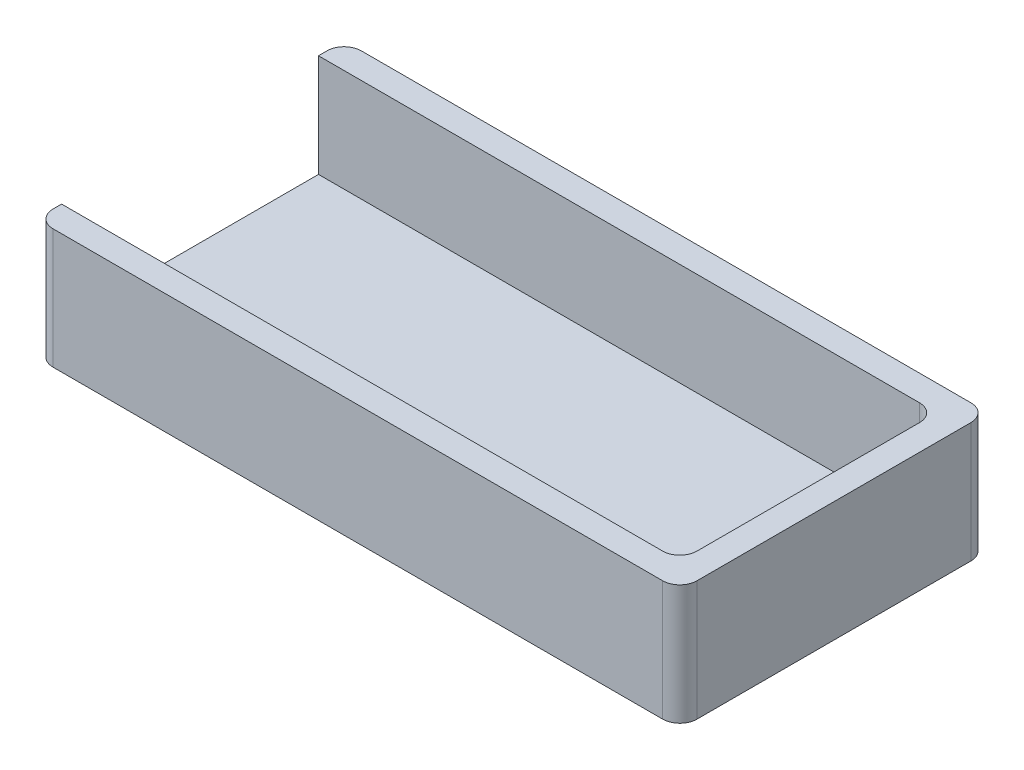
ISO-10303-21;
HEADER;
FILE_DESCRIPTION(('STEP AP214'),'2;1');
FILE_NAME('part.step','',(''),(''),'','','');
FILE_SCHEMA(('AUTOMOTIVE_DESIGN { 1 0 10303 214 1 1 1 1 }'));
ENDSEC;
DATA;
#1=APPLICATION_CONTEXT('core data for automotive mechanical design processes');
#2=APPLICATION_PROTOCOL_DEFINITION('international standard','automotive_design',2000,#1);
#3=PRODUCT_CONTEXT('',#1,'mechanical');
#4=PRODUCT('Part','Part','',(#3));
#5=PRODUCT_RELATED_PRODUCT_CATEGORY('part','',(#4));
#6=PRODUCT_DEFINITION_FORMATION('','',#4);
#7=PRODUCT_DEFINITION_CONTEXT('part definition',#1,'design');
#8=PRODUCT_DEFINITION('design','',#6,#7);
#9=PRODUCT_DEFINITION_SHAPE('','',#8);
#10=(LENGTH_UNIT() NAMED_UNIT(*) SI_UNIT(.MILLI.,.METRE.));
#11=(NAMED_UNIT(*) PLANE_ANGLE_UNIT() SI_UNIT($,.RADIAN.));
#12=(NAMED_UNIT(*) SI_UNIT($,.STERADIAN.) SOLID_ANGLE_UNIT());
#13=UNCERTAINTY_MEASURE_WITH_UNIT(LENGTH_MEASURE(1.E-05),#10,'distance_accuracy_value','');
#14=(GEOMETRIC_REPRESENTATION_CONTEXT(3) GLOBAL_UNCERTAINTY_ASSIGNED_CONTEXT((#13)) GLOBAL_UNIT_ASSIGNED_CONTEXT((#10,
#11,#12)) REPRESENTATION_CONTEXT('',''));
#15=CARTESIAN_POINT('',(0.,0.,0.));
#16=DIRECTION('',(0.,0.,1.));
#17=DIRECTION('',(1.,0.,0.));
#18=AXIS2_PLACEMENT_3D('',#15,#16,#17);
#19=CARTESIAN_POINT('',(0.,1.,0.));
#20=DIRECTION('',(0.,-1.,0.));
#21=DIRECTION('',(0.,0.,-1.));
#22=AXIS2_PLACEMENT_3D('',#19,#20,#21);
#23=PLANE('',#22);
#24=DIRECTION('',(0.,0.,1.));
#25=VECTOR('',#24,1.);
#26=CARTESIAN_POINT('',(36.1,1.,-1.5));
#27=LINE('',#26,#25);
#28=CARTESIAN_POINT('',(36.1,1.,-15.5));
#29=VERTEX_POINT('',#28);
#30=CARTESIAN_POINT('',(36.1,1.,-2.5));
#31=VERTEX_POINT('',#30);
#32=EDGE_CURVE('E187',#29,#31,#27,.T.);
#33=ORIENTED_EDGE('',*,*,#32,.F.);
#34=CARTESIAN_POINT('',(35.1,1.,-15.5));
#35=DIRECTION('',(0.,-1.,0.));
#36=DIRECTION('',(0.,0.,-1.));
#37=AXIS2_PLACEMENT_3D('',#34,#35,#36);
#38=CIRCLE('',#37,1.);
#39=CARTESIAN_POINT('',(35.1,1.,-16.5));
#40=VERTEX_POINT('',#39);
#41=EDGE_CURVE('E258',#29,#40,#38,.F.);
#42=ORIENTED_EDGE('',*,*,#41,.T.);
#43=DIRECTION('',(1.,0.,0.));
#44=VECTOR('',#43,1.);
#45=CARTESIAN_POINT('',(36.1,1.,-16.5));
#46=LINE('',#45,#44);
#47=CARTESIAN_POINT('',(0.,1.,-16.5));
#48=VERTEX_POINT('',#47);
#49=EDGE_CURVE('E199',#48,#40,#46,.T.);
#50=ORIENTED_EDGE('',*,*,#49,.F.);
#51=DIRECTION('',(0.,0.,1.));
#52=VECTOR('',#51,1.);
#53=CARTESIAN_POINT('',(0.,1.,0.));
#54=LINE('',#53,#52);
#55=CARTESIAN_POINT('',(0.,1.,-1.5));
#56=VERTEX_POINT('',#55);
#57=EDGE_CURVE('E163',#48,#56,#54,.T.);
#58=ORIENTED_EDGE('',*,*,#57,.T.);
#59=DIRECTION('',(-1.,0.,0.));
#60=VECTOR('',#59,1.);
#61=CARTESIAN_POINT('',(0.,1.,-1.5));
#62=LINE('',#61,#60);
#63=CARTESIAN_POINT('',(35.1,1.,-1.5));
#64=VERTEX_POINT('',#63);
#65=EDGE_CURVE('E147',#64,#56,#62,.T.);
#66=ORIENTED_EDGE('',*,*,#65,.F.);
#67=CARTESIAN_POINT('',(35.1,1.,-2.5));
#68=DIRECTION('',(0.,-1.,0.));
#69=DIRECTION('',(0.,0.,-1.));
#70=AXIS2_PLACEMENT_3D('',#67,#68,#69);
#71=CIRCLE('',#70,1.);
#72=EDGE_CURVE('E184',#64,#31,#71,.F.);
#73=ORIENTED_EDGE('',*,*,#72,.T.);
#74=EDGE_LOOP('',(#33,#42,#50,#58,#66,#73));
#75=FACE_BOUND('',#74,.T.);
#76=ADVANCED_FACE('F33',(#75),#23,.F.);
#77=CARTESIAN_POINT('',(0.,1.,0.));
#78=DIRECTION('',(1.,0.,0.));
#79=DIRECTION('',(0.,0.,-1.));
#80=AXIS2_PLACEMENT_3D('',#77,#78,#79);
#81=PLANE('',#80);
#82=DIRECTION('',(0.,0.,1.));
#83=VECTOR('',#82,1.);
#84=CARTESIAN_POINT('',(0.,0.,0.));
#85=LINE('',#84,#83);
#86=CARTESIAN_POINT('',(0.,0.,-17.));
#87=VERTEX_POINT('',#86);
#88=CARTESIAN_POINT('',(0.,0.,-1.));
#89=VERTEX_POINT('',#88);
#90=EDGE_CURVE('E164',#87,#89,#85,.T.);
#91=ORIENTED_EDGE('',*,*,#90,.T.);
#92=DIRECTION('',(0.,-1.,0.));
#93=VECTOR('',#92,1.);
#94=CARTESIAN_POINT('',(0.,1.,-1.));
#95=LINE('',#94,#93);
#96=CARTESIAN_POINT('',(0.,7.,-1.));
#97=VERTEX_POINT('',#96);
#98=EDGE_CURVE('E255',#89,#97,#95,.F.);
#99=ORIENTED_EDGE('',*,*,#98,.T.);
#100=DIRECTION('',(0.,0.,1.));
#101=VECTOR('',#100,1.);
#102=CARTESIAN_POINT('',(0.,7.,0.));
#103=LINE('',#102,#101);
#104=CARTESIAN_POINT('',(0.,7.,-1.5));
#105=VERTEX_POINT('',#104);
#106=EDGE_CURVE('E222',#105,#97,#103,.T.);
#107=ORIENTED_EDGE('',*,*,#106,.F.);
#108=DIRECTION('',(0.,-1.,0.));
#109=VECTOR('',#108,1.);
#110=CARTESIAN_POINT('',(0.,7.,-1.5));
#111=LINE('',#110,#109);
#112=EDGE_CURVE('E165',#105,#56,#111,.T.);
#113=ORIENTED_EDGE('',*,*,#112,.T.);
#114=ORIENTED_EDGE('',*,*,#57,.F.);
#115=DIRECTION('',(0.,-1.,0.));
#116=VECTOR('',#115,1.);
#117=CARTESIAN_POINT('',(0.,7.,-16.5));
#118=LINE('',#117,#116);
#119=CARTESIAN_POINT('',(0.,7.,-16.5));
#120=VERTEX_POINT('',#119);
#121=EDGE_CURVE('E153',#120,#48,#118,.T.);
#122=ORIENTED_EDGE('',*,*,#121,.F.);
#123=DIRECTION('',(0.,0.,1.));
#124=VECTOR('',#123,1.);
#125=CARTESIAN_POINT('',(0.,7.,-16.5));
#126=LINE('',#125,#124);
#127=CARTESIAN_POINT('',(0.,7.,-17.));
#128=VERTEX_POINT('',#127);
#129=EDGE_CURVE('E134',#128,#120,#126,.T.);
#130=ORIENTED_EDGE('',*,*,#129,.F.);
#131=DIRECTION('',(0.,-1.,0.));
#132=VECTOR('',#131,1.);
#133=CARTESIAN_POINT('',(0.,1.,-17.));
#134=LINE('',#133,#132);
#135=EDGE_CURVE('E239',#128,#87,#134,.T.);
#136=ORIENTED_EDGE('',*,*,#135,.T.);
#137=EDGE_LOOP('',(#91,#99,#107,#113,#114,#122,#130,#136));
#138=FACE_BOUND('',#137,.T.);
#139=ADVANCED_FACE('F160',(#138),#81,.F.);
#140=CARTESIAN_POINT('',(0.,1.,0.));
#141=DIRECTION('',(0.,0.,-1.));
#142=DIRECTION('',(-1.,0.,0.));
#143=AXIS2_PLACEMENT_3D('',#140,#141,#142);
#144=PLANE('',#143);
#145=DIRECTION('',(1.,0.,0.));
#146=VECTOR('',#145,1.);
#147=CARTESIAN_POINT('',(0.,0.,0.));
#148=LINE('',#147,#146);
#149=CARTESIAN_POINT('',(1.,0.,0.));
#150=VERTEX_POINT('',#149);
#151=CARTESIAN_POINT('',(36.6,0.,0.));
#152=VERTEX_POINT('',#151);
#153=EDGE_CURVE('E167',#150,#152,#148,.T.);
#154=ORIENTED_EDGE('',*,*,#153,.T.);
#155=DIRECTION('',(0.,-1.,0.));
#156=VECTOR('',#155,1.);
#157=CARTESIAN_POINT('',(36.6,1.,0.));
#158=LINE('',#157,#156);
#159=CARTESIAN_POINT('',(36.6,7.,0.));
#160=VERTEX_POINT('',#159);
#161=EDGE_CURVE('E48',#152,#160,#158,.F.);
#162=ORIENTED_EDGE('',*,*,#161,.T.);
#163=DIRECTION('',(1.,0.,0.));
#164=VECTOR('',#163,1.);
#165=CARTESIAN_POINT('',(37.6,7.,0.));
#166=LINE('',#165,#164);
#167=CARTESIAN_POINT('',(1.,7.,0.));
#168=VERTEX_POINT('',#167);
#169=EDGE_CURVE('E224',#168,#160,#166,.T.);
#170=ORIENTED_EDGE('',*,*,#169,.F.);
#171=DIRECTION('',(0.,-1.,0.));
#172=VECTOR('',#171,1.);
#173=CARTESIAN_POINT('',(1.,1.,0.));
#174=LINE('',#173,#172);
#175=EDGE_CURVE('E250',#168,#150,#174,.T.);
#176=ORIENTED_EDGE('',*,*,#175,.T.);
#177=EDGE_LOOP('',(#154,#162,#170,#176));
#178=FACE_BOUND('',#177,.T.);
#179=ADVANCED_FACE('F288',(#178),#144,.F.);
#180=CARTESIAN_POINT('',(37.6,1.,0.));
#181=DIRECTION('',(-1.,0.,0.));
#182=DIRECTION('',(0.,0.,1.));
#183=AXIS2_PLACEMENT_3D('',#180,#181,#182);
#184=PLANE('',#183);
#185=DIRECTION('',(0.,0.,-1.));
#186=VECTOR('',#185,1.);
#187=CARTESIAN_POINT('',(37.6,0.,0.));
#188=LINE('',#187,#186);
#189=CARTESIAN_POINT('',(37.6,0.,-1.));
#190=VERTEX_POINT('',#189);
#191=CARTESIAN_POINT('',(37.6,0.,-17.));
#192=VERTEX_POINT('',#191);
#193=EDGE_CURVE('E279',#190,#192,#188,.T.);
#194=ORIENTED_EDGE('',*,*,#193,.T.);
#195=DIRECTION('',(0.,-1.,0.));
#196=VECTOR('',#195,1.);
#197=CARTESIAN_POINT('',(37.6,1.,-17.));
#198=LINE('',#197,#196);
#199=CARTESIAN_POINT('',(37.6,7.,-17.));
#200=VERTEX_POINT('',#199);
#201=EDGE_CURVE('E240',#192,#200,#198,.F.);
#202=ORIENTED_EDGE('',*,*,#201,.T.);
#203=DIRECTION('',(0.,0.,-1.));
#204=VECTOR('',#203,1.);
#205=CARTESIAN_POINT('',(37.6,7.,-18.));
#206=LINE('',#205,#204);
#207=CARTESIAN_POINT('',(37.6,7.,-1.));
#208=VERTEX_POINT('',#207);
#209=EDGE_CURVE('E229',#208,#200,#206,.T.);
#210=ORIENTED_EDGE('',*,*,#209,.F.);
#211=DIRECTION('',(0.,-1.,0.));
#212=VECTOR('',#211,1.);
#213=CARTESIAN_POINT('',(37.6,1.,-1.));
#214=LINE('',#213,#212);
#215=EDGE_CURVE('E244',#208,#190,#214,.T.);
#216=ORIENTED_EDGE('',*,*,#215,.T.);
#217=EDGE_LOOP('',(#194,#202,#210,#216));
#218=FACE_BOUND('',#217,.T.);
#219=ADVANCED_FACE('F278',(#218),#184,.F.);
#220=CARTESIAN_POINT('',(0.,1.,-18.));
#221=DIRECTION('',(0.,0.,1.));
#222=DIRECTION('',(1.,0.,0.));
#223=AXIS2_PLACEMENT_3D('',#220,#221,#222);
#224=PLANE('',#223);
#225=DIRECTION('',(-1.,0.,0.));
#226=VECTOR('',#225,1.);
#227=CARTESIAN_POINT('',(0.,7.,-18.));
#228=LINE('',#227,#226);
#229=CARTESIAN_POINT('',(36.6,7.,-18.));
#230=VERTEX_POINT('',#229);
#231=CARTESIAN_POINT('',(1.,7.,-18.));
#232=VERTEX_POINT('',#231);
#233=EDGE_CURVE('E169',#230,#232,#228,.T.);
#234=ORIENTED_EDGE('',*,*,#233,.F.);
#235=DIRECTION('',(0.,-1.,0.));
#236=VECTOR('',#235,1.);
#237=CARTESIAN_POINT('',(36.6,1.,-18.));
#238=LINE('',#237,#236);
#239=CARTESIAN_POINT('',(36.6,0.,-18.));
#240=VERTEX_POINT('',#239);
#241=EDGE_CURVE('E263',#230,#240,#238,.T.);
#242=ORIENTED_EDGE('',*,*,#241,.T.);
#243=DIRECTION('',(-1.,0.,0.));
#244=VECTOR('',#243,1.);
#245=CARTESIAN_POINT('',(0.,0.,-18.));
#246=LINE('',#245,#244);
#247=CARTESIAN_POINT('',(1.,0.,-18.));
#248=VERTEX_POINT('',#247);
#249=EDGE_CURVE('E197',#240,#248,#246,.T.);
#250=ORIENTED_EDGE('',*,*,#249,.T.);
#251=DIRECTION('',(0.,-1.,0.));
#252=VECTOR('',#251,1.);
#253=CARTESIAN_POINT('',(1.,1.,-18.));
#254=LINE('',#253,#252);
#255=EDGE_CURVE('E238',#248,#232,#254,.F.);
#256=ORIENTED_EDGE('',*,*,#255,.T.);
#257=EDGE_LOOP('',(#234,#242,#250,#256));
#258=FACE_BOUND('',#257,.T.);
#259=ADVANCED_FACE('F295',(#258),#224,.F.);
#260=CARTESIAN_POINT('',(0.,0.,0.));
#261=DIRECTION('',(0.,-1.,0.));
#262=DIRECTION('',(0.,0.,-1.));
#263=AXIS2_PLACEMENT_3D('',#260,#261,#262);
#264=PLANE('',#263);
#265=ORIENTED_EDGE('',*,*,#249,.F.);
#266=CARTESIAN_POINT('',(36.6,0.,-17.));
#267=DIRECTION('',(0.,-1.,0.));
#268=DIRECTION('',(0.,0.,-1.));
#269=AXIS2_PLACEMENT_3D('',#266,#267,#268);
#270=CIRCLE('',#269,1.);
#271=EDGE_CURVE('E271',#240,#192,#270,.T.);
#272=ORIENTED_EDGE('',*,*,#271,.T.);
#273=ORIENTED_EDGE('',*,*,#193,.F.);
#274=CARTESIAN_POINT('',(36.6,0.,-1.));
#275=DIRECTION('',(0.,-1.,0.));
#276=DIRECTION('',(0.,0.,-1.));
#277=AXIS2_PLACEMENT_3D('',#274,#275,#276);
#278=CIRCLE('',#277,1.);
#279=EDGE_CURVE('E269',#190,#152,#278,.T.);
#280=ORIENTED_EDGE('',*,*,#279,.T.);
#281=ORIENTED_EDGE('',*,*,#153,.F.);
#282=CARTESIAN_POINT('',(1.,0.,-1.));
#283=DIRECTION('',(0.,-1.,0.));
#284=DIRECTION('',(0.,0.,-1.));
#285=AXIS2_PLACEMENT_3D('',#282,#283,#284);
#286=CIRCLE('',#285,1.);
#287=EDGE_CURVE('E267',#150,#89,#286,.T.);
#288=ORIENTED_EDGE('',*,*,#287,.T.);
#289=ORIENTED_EDGE('',*,*,#90,.F.);
#290=CARTESIAN_POINT('',(1.,0.,-17.));
#291=DIRECTION('',(0.,-1.,0.));
#292=DIRECTION('',(0.,0.,-1.));
#293=AXIS2_PLACEMENT_3D('',#290,#291,#292);
#294=CIRCLE('',#293,1.);
#295=EDGE_CURVE('E265',#87,#248,#294,.T.);
#296=ORIENTED_EDGE('',*,*,#295,.T.);
#297=EDGE_LOOP('',(#265,#272,#273,#280,#281,#288,#289,#296));
#298=FACE_BOUND('',#297,.T.);
#299=ADVANCED_FACE('F285',(#298),#264,.T.);
#300=CARTESIAN_POINT('',(36.1,7.,-16.5));
#301=DIRECTION('',(0.,0.,-1.));
#302=DIRECTION('',(-1.,0.,0.));
#303=AXIS2_PLACEMENT_3D('',#300,#301,#302);
#304=PLANE('',#303);
#305=ORIENTED_EDGE('',*,*,#49,.T.);
#306=DIRECTION('',(0.,-1.,0.));
#307=VECTOR('',#306,1.);
#308=CARTESIAN_POINT('',(35.1,7.,-16.5));
#309=LINE('',#308,#307);
#310=CARTESIAN_POINT('',(35.1,7.,-16.5));
#311=VERTEX_POINT('',#310);
#312=EDGE_CURVE('E155',#40,#311,#309,.F.);
#313=ORIENTED_EDGE('',*,*,#312,.T.);
#314=DIRECTION('',(1.,0.,0.));
#315=VECTOR('',#314,1.);
#316=CARTESIAN_POINT('',(36.1,7.,-16.5));
#317=LINE('',#316,#315);
#318=EDGE_CURVE('E138',#120,#311,#317,.T.);
#319=ORIENTED_EDGE('',*,*,#318,.F.);
#320=ORIENTED_EDGE('',*,*,#121,.T.);
#321=EDGE_LOOP('',(#305,#313,#319,#320));
#322=FACE_BOUND('',#321,.T.);
#323=ADVANCED_FACE('F152',(#322),#304,.F.);
#324=CARTESIAN_POINT('',(36.1,7.,-1.5));
#325=DIRECTION('',(1.,0.,0.));
#326=DIRECTION('',(0.,0.,-1.));
#327=AXIS2_PLACEMENT_3D('',#324,#325,#326);
#328=PLANE('',#327);
#329=DIRECTION('',(0.,0.,1.));
#330=VECTOR('',#329,1.);
#331=CARTESIAN_POINT('',(36.1,7.,-1.5));
#332=LINE('',#331,#330);
#333=CARTESIAN_POINT('',(36.1,7.,-15.5));
#334=VERTEX_POINT('',#333);
#335=CARTESIAN_POINT('',(36.1,7.,-2.5));
#336=VERTEX_POINT('',#335);
#337=EDGE_CURVE('E156',#334,#336,#332,.T.);
#338=ORIENTED_EDGE('',*,*,#337,.F.);
#339=DIRECTION('',(0.,-1.,0.));
#340=VECTOR('',#339,1.);
#341=CARTESIAN_POINT('',(36.1,1.,-15.5));
#342=LINE('',#341,#340);
#343=EDGE_CURVE('E181',#334,#29,#342,.T.);
#344=ORIENTED_EDGE('',*,*,#343,.T.);
#345=ORIENTED_EDGE('',*,*,#32,.T.);
#346=DIRECTION('',(0.,-1.,0.));
#347=VECTOR('',#346,1.);
#348=CARTESIAN_POINT('',(36.1,7.,-2.5));
#349=LINE('',#348,#347);
#350=EDGE_CURVE('E179',#31,#336,#349,.F.);
#351=ORIENTED_EDGE('',*,*,#350,.T.);
#352=EDGE_LOOP('',(#338,#344,#345,#351));
#353=FACE_BOUND('',#352,.T.);
#354=ADVANCED_FACE('F205',(#353),#328,.F.);
#355=CARTESIAN_POINT('',(0.,7.,-1.5));
#356=DIRECTION('',(0.,0.,1.));
#357=DIRECTION('',(1.,0.,0.));
#358=AXIS2_PLACEMENT_3D('',#355,#356,#357);
#359=PLANE('',#358);
#360=DIRECTION('',(-1.,0.,0.));
#361=VECTOR('',#360,1.);
#362=CARTESIAN_POINT('',(0.,7.,-1.5));
#363=LINE('',#362,#361);
#364=CARTESIAN_POINT('',(35.1,7.,-1.5));
#365=VERTEX_POINT('',#364);
#366=EDGE_CURVE('E216',#365,#105,#363,.T.);
#367=ORIENTED_EDGE('',*,*,#366,.F.);
#368=DIRECTION('',(0.,-1.,0.));
#369=VECTOR('',#368,1.);
#370=CARTESIAN_POINT('',(35.1,1.,-1.5));
#371=LINE('',#370,#369);
#372=EDGE_CURVE('E214',#365,#64,#371,.T.);
#373=ORIENTED_EDGE('',*,*,#372,.T.);
#374=ORIENTED_EDGE('',*,*,#65,.T.);
#375=ORIENTED_EDGE('',*,*,#112,.F.);
#376=EDGE_LOOP('',(#367,#373,#374,#375));
#377=FACE_BOUND('',#376,.T.);
#378=ADVANCED_FACE('F219',(#377),#359,.F.);
#379=CARTESIAN_POINT('',(0.,7.,0.));
#380=DIRECTION('',(0.,-1.,0.));
#381=DIRECTION('',(0.,0.,-1.));
#382=AXIS2_PLACEMENT_3D('',#379,#380,#381);
#383=PLANE('',#382);
#384=ORIENTED_EDGE('',*,*,#209,.T.);
#385=CARTESIAN_POINT('',(36.6,7.,-17.));
#386=DIRECTION('',(0.,-1.,0.));
#387=DIRECTION('',(0.,0.,-1.));
#388=AXIS2_PLACEMENT_3D('',#385,#386,#387);
#389=CIRCLE('',#388,1.);
#390=EDGE_CURVE('E232',#200,#230,#389,.F.);
#391=ORIENTED_EDGE('',*,*,#390,.T.);
#392=ORIENTED_EDGE('',*,*,#233,.T.);
#393=CARTESIAN_POINT('',(1.,7.,-17.));
#394=DIRECTION('',(0.,-1.,0.));
#395=DIRECTION('',(0.,0.,-1.));
#396=AXIS2_PLACEMENT_3D('',#393,#394,#395);
#397=CIRCLE('',#396,1.);
#398=EDGE_CURVE('E142',#232,#128,#397,.F.);
#399=ORIENTED_EDGE('',*,*,#398,.T.);
#400=ORIENTED_EDGE('',*,*,#129,.T.);
#401=ORIENTED_EDGE('',*,*,#318,.T.);
#402=CARTESIAN_POINT('',(35.1,7.,-15.5));
#403=DIRECTION('',(0.,-1.,0.));
#404=DIRECTION('',(0.,0.,-1.));
#405=AXIS2_PLACEMENT_3D('',#402,#403,#404);
#406=CIRCLE('',#405,1.);
#407=EDGE_CURVE('E41',#311,#334,#406,.T.);
#408=ORIENTED_EDGE('',*,*,#407,.T.);
#409=ORIENTED_EDGE('',*,*,#337,.T.);
#410=CARTESIAN_POINT('',(35.1,7.,-2.5));
#411=DIRECTION('',(0.,-1.,0.));
#412=DIRECTION('',(0.,0.,-1.));
#413=AXIS2_PLACEMENT_3D('',#410,#411,#412);
#414=CIRCLE('',#413,1.);
#415=EDGE_CURVE('E11',#336,#365,#414,.T.);
#416=ORIENTED_EDGE('',*,*,#415,.T.);
#417=ORIENTED_EDGE('',*,*,#366,.T.);
#418=ORIENTED_EDGE('',*,*,#106,.T.);
#419=CARTESIAN_POINT('',(1.,7.,-1.));
#420=DIRECTION('',(0.,-1.,0.));
#421=DIRECTION('',(0.,0.,-1.));
#422=AXIS2_PLACEMENT_3D('',#419,#420,#421);
#423=CIRCLE('',#422,1.);
#424=EDGE_CURVE('E55',#97,#168,#423,.F.);
#425=ORIENTED_EDGE('',*,*,#424,.T.);
#426=ORIENTED_EDGE('',*,*,#169,.T.);
#427=CARTESIAN_POINT('',(36.6,7.,-1.));
#428=DIRECTION('',(0.,-1.,0.));
#429=DIRECTION('',(0.,0.,-1.));
#430=AXIS2_PLACEMENT_3D('',#427,#428,#429);
#431=CIRCLE('',#430,1.);
#432=EDGE_CURVE('E242',#160,#208,#431,.F.);
#433=ORIENTED_EDGE('',*,*,#432,.T.);
#434=EDGE_LOOP('',(#384,#391,#392,#399,#400,#401,#408,#409,#416,#417,#418,#425,#426,#433));
#435=FACE_BOUND('',#434,.T.);
#436=ADVANCED_FACE('F137',(#435),#383,.F.);
#437=CARTESIAN_POINT('',(35.1,7.,-15.5));
#438=DIRECTION('',(0.,1.,0.));
#439=DIRECTION('',(0.,0.,1.));
#440=AXIS2_PLACEMENT_3D('',#437,#438,#439);
#441=CYLINDRICAL_SURFACE('',#440,1.);
#442=ORIENTED_EDGE('',*,*,#407,.F.);
#443=ORIENTED_EDGE('',*,*,#312,.F.);
#444=ORIENTED_EDGE('',*,*,#41,.F.);
#445=ORIENTED_EDGE('',*,*,#343,.F.);
#446=EDGE_LOOP('',(#442,#443,#444,#445));
#447=FACE_BOUND('',#446,.T.);
#448=ADVANCED_FACE('F257',(#447),#441,.F.);
#449=CARTESIAN_POINT('',(35.1,7.,-2.5));
#450=DIRECTION('',(0.,1.,0.));
#451=DIRECTION('',(0.,0.,1.));
#452=AXIS2_PLACEMENT_3D('',#449,#450,#451);
#453=CYLINDRICAL_SURFACE('',#452,1.);
#454=ORIENTED_EDGE('',*,*,#415,.F.);
#455=ORIENTED_EDGE('',*,*,#350,.F.);
#456=ORIENTED_EDGE('',*,*,#72,.F.);
#457=ORIENTED_EDGE('',*,*,#372,.F.);
#458=EDGE_LOOP('',(#454,#455,#456,#457));
#459=FACE_BOUND('',#458,.T.);
#460=ADVANCED_FACE('F211',(#459),#453,.F.);
#461=CARTESIAN_POINT('',(36.6,1.,-17.));
#462=DIRECTION('',(0.,-1.,0.));
#463=DIRECTION('',(0.,0.,-1.));
#464=AXIS2_PLACEMENT_3D('',#461,#462,#463);
#465=CYLINDRICAL_SURFACE('',#464,1.);
#466=ORIENTED_EDGE('',*,*,#390,.F.);
#467=ORIENTED_EDGE('',*,*,#201,.F.);
#468=ORIENTED_EDGE('',*,*,#271,.F.);
#469=ORIENTED_EDGE('',*,*,#241,.F.);
#470=EDGE_LOOP('',(#466,#467,#468,#469));
#471=FACE_BOUND('',#470,.T.);
#472=ADVANCED_FACE('F297',(#471),#465,.T.);
#473=CARTESIAN_POINT('',(36.6,1.,-1.));
#474=DIRECTION('',(0.,-1.,0.));
#475=DIRECTION('',(0.,0.,-1.));
#476=AXIS2_PLACEMENT_3D('',#473,#474,#475);
#477=CYLINDRICAL_SURFACE('',#476,1.);
#478=ORIENTED_EDGE('',*,*,#432,.F.);
#479=ORIENTED_EDGE('',*,*,#161,.F.);
#480=ORIENTED_EDGE('',*,*,#279,.F.);
#481=ORIENTED_EDGE('',*,*,#215,.F.);
#482=EDGE_LOOP('',(#478,#479,#480,#481));
#483=FACE_BOUND('',#482,.T.);
#484=ADVANCED_FACE('F290',(#483),#477,.T.);
#485=CARTESIAN_POINT('',(1.,1.,-1.));
#486=DIRECTION('',(0.,-1.,0.));
#487=DIRECTION('',(0.,0.,-1.));
#488=AXIS2_PLACEMENT_3D('',#485,#486,#487);
#489=CYLINDRICAL_SURFACE('',#488,1.);
#490=ORIENTED_EDGE('',*,*,#424,.F.);
#491=ORIENTED_EDGE('',*,*,#98,.F.);
#492=ORIENTED_EDGE('',*,*,#287,.F.);
#493=ORIENTED_EDGE('',*,*,#175,.F.);
#494=EDGE_LOOP('',(#490,#491,#492,#493));
#495=FACE_BOUND('',#494,.T.);
#496=ADVANCED_FACE('F292',(#495),#489,.T.);
#497=CARTESIAN_POINT('',(1.,1.,-17.));
#498=DIRECTION('',(0.,-1.,0.));
#499=DIRECTION('',(0.,0.,-1.));
#500=AXIS2_PLACEMENT_3D('',#497,#498,#499);
#501=CYLINDRICAL_SURFACE('',#500,1.);
#502=ORIENTED_EDGE('',*,*,#398,.F.);
#503=ORIENTED_EDGE('',*,*,#255,.F.);
#504=ORIENTED_EDGE('',*,*,#295,.F.);
#505=ORIENTED_EDGE('',*,*,#135,.F.);
#506=EDGE_LOOP('',(#502,#503,#504,#505));
#507=FACE_BOUND('',#506,.T.);
#508=ADVANCED_FACE('F35',(#507),#501,.T.);
#509=CLOSED_SHELL('',(#76,#139,#179,#219,#259,#299,#323,#354,#378,#436,#448,#460,#472,#484,#496,#508));
#510=MANIFOLD_SOLID_BREP('B2',#509);
#511=ADVANCED_BREP_SHAPE_REPRESENTATION('',(#18,#510),#14);
#512=SHAPE_DEFINITION_REPRESENTATION(#9,#511);
ENDSEC;
END-ISO-10303-21;
